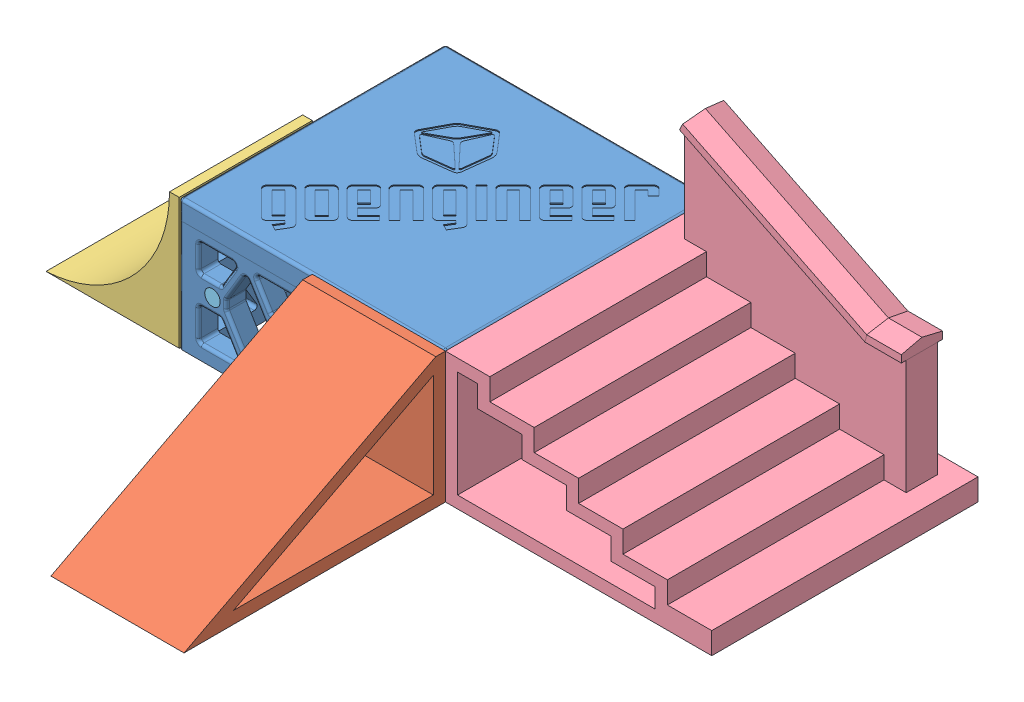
SolidWorks assembly Skate park - finished.SLDASM, configuration Default (file format 14000). Lengths in mm.
Overall size (349.28 125.08 276.86).
28 component instances, 5 part files, 64 mates.
Components (placement in the parent):
- Main base-1: Main base.SLDPRT [Default] at origin size (139.7 68.58 139.7)
- Ramp-1: Ramp.SLDPRT [Default] at (34.925 -68.58 69.85) x (0 0 1) z (-1 0 0) size (137.16 68.58 69.85)
- Ramp2-1: Ramp2.SLDPRT [Default] at (-69.85 -68.58 34.925) x (-1 0 0) z (0 0 -1) size (69.88 68.58 69.85)
- Steps-1: Steps.SLDPRT [Default] at (69.85 -68.58 0) size (139.7 125.08 139.7)
- Magnet-finished-1: Magnet-finished.SLDPRT [Default] at (-52.3875 -36.83 66.802) x (1 0 0) z (0 -1 0) size (8.13 3.05 8.13)
- Magnet-finished-2: Magnet-finished.SLDPRT [Default] at (-17.4625 -36.83 66.802) x (1 0 0) z (0 -1 0) size (8.13 3.05 8.13)
- Magnet-finished-3: Magnet-finished.SLDPRT [Default] at (17.4625 -36.83 66.802) x (1 0 0) z (0 -1 0) size (8.13 3.05 8.13)
- Magnet-finished-4: Magnet-finished.SLDPRT [Default] at (52.3875 -36.83 66.802) x (1 0 0) z (0 -1 0) size (8.13 3.05 8.13)
- Magnet-finished-5: Magnet-finished.SLDPRT [Default] at (66.802 -36.83 52.3875) x (0 -1 0) z (0 0 1) size (8.13 3.05 8.13)
- Magnet-finished-6: Magnet-finished.SLDPRT [Default] at (66.802 -36.83 17.4625) x (0 -1 0) z (0 0 1) size (8.13 3.05 8.13)
- Magnet-finished-9: Magnet-finished.SLDPRT [Default] at (52.3875 -36.83 -66.802) x (1 0 0) z (0 1 0) size (8.13 3.05 8.13)
- Magnet-finished-10: Magnet-finished.SLDPRT [Default] at (17.4625 -36.83 -66.802) x (1 0 0) z (0 1 0) size (8.13 3.05 8.13)
- Magnet-finished-11: Magnet-finished.SLDPRT [Default] at (-17.4625 -36.83 -66.802) x (1 0 0) z (0 1 0) size (8.13 3.05 8.13)
- Magnet-finished-13: Magnet-finished.SLDPRT [Default] at (-66.802 -36.83 -52.3875) x (0 1 0) z (0 0 1) size (8.13 3.05 8.13)
- Magnet-finished-14: Magnet-finished.SLDPRT [Default] at (-66.802 -36.83 -17.4625) x (0 1 0) z (0 0 1) size (8.13 3.05 8.13)
- Magnet-finished-15: Magnet-finished.SLDPRT [Default] at (-66.802 -36.83 17.4625) x (0 1 0) z (0 0 1) size (8.13 3.05 8.13)
- Magnet-finished-16: Magnet-finished.SLDPRT [Default] at (-66.802 -36.83 52.3875) x (0 1 0) z (0 0 1) size (8.13 3.05 8.13)
- Magnet-finished-17: Magnet-finished.SLDPRT [Default] at (66.802 -36.83 -52.3875) x (0 -1 0) z (0 0 1) size (8.13 3.05 8.13)
- Magnet-finished-19: Magnet-finished.SLDPRT [Default] at (-52.3875 -36.83 -66.802) x (1 0 0) z (0 1 0) size (8.13 3.05 8.13)
- Magnet-finished-21: Magnet-finished.SLDPRT [Default] at (66.802 -36.83 -17.4625) x (0 -1 0) z (0 0 1) size (8.13 3.05 8.13)
- Magnet-finished-22: Magnet-finished.SLDPRT [Default] at (52.3875 -36.83 69.85) x (-0.265294 -0.964167 0) z (-0.964167 0.265294 0) size (8.13 3.05 8.13)
- Magnet-finished-23: Magnet-finished.SLDPRT [Default] at (17.4625 -36.83 69.85) x (0.90035 0.435167 0) z (0.435167 -0.90035 0) size (8.13 3.05 8.13)
- Magnet-finished-24: Magnet-finished.SLDPRT [Default] at (69.85 -36.83 52.3875) x (0 0.924225 0.381849) z (0 0.381849 -0.924225) size (8.13 3.05 8.13)
- Magnet-finished-25: Magnet-finished.SLDPRT [Default] at (69.85 -36.83 17.4625) x (0 0.924225 0.381849) z (0 0.381849 -0.924225) size (8.13 3.05 8.13)
- Magnet-finished-26: Magnet-finished.SLDPRT [Default] at (69.85 -36.83 -17.4625) x (0 0.924225 0.381849) z (0 0.381849 -0.924225) size (8.13 3.05 8.13)
- Magnet-finished-27: Magnet-finished.SLDPRT [Default] at (69.85 -36.83 -52.3875) x (0 0.924225 0.381849) z (0 0.381849 -0.924225) size (8.13 3.05 8.13)
- Magnet-finished-28: Magnet-finished.SLDPRT [Default] at (-69.85 -36.83 52.3875) x (0 -0.995715 0.09248) z (0 -0.09248 -0.995715) size (8.13 3.05 8.13)
- Magnet-finished-29: Magnet-finished.SLDPRT [Default] at (-69.85 -36.83 17.4625) x (0 0.465685 0.88495) z (0 -0.88495 0.465685) size (8.13 3.05 8.13)
Mates (geometry in assembly coordinates):
- Concentric11: concentric anti-aligned: cylinder of Main base-1 through (-52.3875 -36.83 66.802) axis (0 0 1) radius 4.064; cylinder of Magnet-1 through (-52.3875 -36.83 69.85) axis (0 0 -1) radius 4.064
- Coincident11: coincident anti-aligned: plane of Main base-1 through (-52.3875 -36.83 66.802) normal (0 0 1); plane of Magnet-1 through (-52.3875 -36.83 66.802) normal (0 0 -1)
- Concentric21: concentric anti-aligned: cylinder of Main base-1 through (-17.4625 -36.83 66.802) axis (0 0 1) radius 4.064; cylinder of Magnet-2 through (-17.4625 -36.83 69.85) axis (0 0 -1) radius 4.064
- Coincident21: coincident anti-aligned: plane of Main base-1 through (-17.4625 -36.83 66.802) normal (0 0 1); plane of Magnet-2 through (-17.4625 -36.83 66.802) normal (0 0 -1)
- Concentric31: concentric anti-aligned: cylinder of Main base-1 through (17.4625 -36.83 66.802) axis (0 0 1) radius 4.064; cylinder of Magnet-3 through (17.4625 -36.83 69.85) axis (0 0 -1) radius 4.064
- Coincident31: coincident anti-aligned: plane of Main base-1 through (17.4625 -36.83 66.802) normal (0 0 1); plane of Magnet-3 through (17.4625 -36.83 66.802) normal (0 0 -1)
- Concentric41: concentric anti-aligned: cylinder of Main base-1 through (52.3875 -36.83 66.802) axis (0 0 1) radius 4.064; cylinder of Magnet-4 through (52.3875 -36.83 69.85) axis (0 0 -1) radius 4.064
- Coincident41: coincident anti-aligned: plane of Main base-1 through (52.3875 -36.83 66.802) normal (0 0 1); plane of Magnet-4 through (52.3875 -36.83 66.802) normal (0 0 -1)
- Concentric51: concentric anti-aligned: cylinder of Main base-1 through (66.802 -36.83 52.3875) axis (1 0 0) radius 4.064; cylinder of Magnet-5 through (69.85 -36.83 52.3875) axis (-1 0 0) radius 4.064
- Coincident51: coincident anti-aligned: plane of Main base-1 through (66.802 -36.83 52.3875) normal (1 0 0); plane of Magnet-5 through (66.802 -36.83 52.3875) normal (-1 0 0)
- Concentric61: concentric anti-aligned: cylinder of Main base-1 through (66.802 -36.83 17.4625) axis (1 0 0) radius 4.064; cylinder of Magnet-6 through (69.85 -36.83 17.4625) axis (-1 0 0) radius 4.064
- Coincident61: coincident anti-aligned: plane of Main base-1 through (66.802 -36.83 17.4625) normal (1 0 0); plane of Magnet-6 through (66.802 -36.83 17.4625) normal (-1 0 0)
- Coincident71: coincident anti-aligned: plane of Main base-1 through (69.85 -10.16 -59.69) normal (1 0 0); plane of Magnet-8 through (69.85 -54.2156 -62.8356) normal (-1 0 0)
- Concentric71: concentric anti-aligned: cylinder of Main base-1 through (52.3875 -36.83 -66.802) axis (0 0 -1) radius 4.064; cylinder of Magnet-9 through (52.3875 -36.83 -69.85) axis (0 0 1) radius 4.064
- Coincident81: coincident anti-aligned: plane of Main base-1 through (52.3875 -36.83 -66.802) normal (0 0 -1); plane of Magnet-9 through (52.3875 -36.83 -66.802) normal (0 0 1)
- Concentric81: concentric anti-aligned: cylinder of Main base-1 through (17.4625 -36.83 -66.802) axis (0 0 -1) radius 4.064; cylinder of Magnet-10 through (17.4625 -36.83 -69.85) axis (0 0 1) radius 4.064
- Coincident91: coincident anti-aligned: plane of Main base-1 through (17.4625 -36.83 -66.802) normal (0 0 -1); plane of Magnet-10 through (17.4625 -36.83 -66.802) normal (0 0 1)
- Concentric91: concentric anti-aligned: cylinder of Main base-1 through (-17.4625 -36.83 -66.802) axis (0 0 -1) radius 4.064; cylinder of Magnet-11 through (-17.4625 -36.83 -69.85) axis (0 0 1) radius 4.064
- Coincident101: coincident anti-aligned: plane of Main base-1 through (-17.4625 -36.83 -66.802) normal (0 0 -1); plane of Magnet-11 through (-17.4625 -36.83 -66.802) normal (0 0 1)
- Concentric101: concentric: cylinder of Main base-1 through (-52.3875 -36.83 -66.802) axis (0 0 -1) radius 4.064; cylinder of Magnet-12 through (-58.2387 -35.1591 -64.283) axis (0 -1 0) radius 4.064
- Coincident111: coincident: plane of Main base-1 through (0 0 -69.85) normal (0 0 -1); plane of Magnet-12 through (-58.2387 -38.2071 -64.283) normal (0 -1 0)
- Concentric111: concentric anti-aligned: cylinder of Main base-1 through (-66.802 -36.83 -52.3875) axis (-1 0 0) radius 4.064; cylinder of Magnet-13 through (-69.85 -36.83 -52.3875) axis (1 0 0) radius 4.064
- Coincident121: coincident anti-aligned: plane of Main base-1 through (-66.802 -36.83 -52.3875) normal (-1 0 0); plane of Magnet-13 through (-66.802 -36.83 -52.3875) normal (1 0 0)
- Concentric121: concentric anti-aligned: cylinder of Main base-1 through (-66.802 -36.83 -17.4625) axis (-1 0 0) radius 4.064; cylinder of Magnet-14 through (-69.85 -36.83 -17.4625) axis (1 0 0) radius 4.064
- Coincident131: coincident anti-aligned: plane of Main base-1 through (-66.802 -36.83 -17.4625) normal (-1 0 0); plane of Magnet-14 through (-66.802 -36.83 -17.4625) normal (1 0 0)
- Concentric131: concentric anti-aligned: cylinder of Main base-1 through (-66.802 -36.83 17.4625) axis (-1 0 0) radius 4.064; cylinder of Magnet-15 through (-69.85 -36.83 17.4625) axis (1 0 0) radius 4.064
- Coincident141: coincident anti-aligned: plane of Main base-1 through (-66.802 -36.83 17.4625) normal (-1 0 0); plane of Magnet-15 through (-66.802 -36.83 17.4625) normal (1 0 0)
- Concentric141: concentric anti-aligned: cylinder of Main base-1 through (-66.802 -36.83 52.3875) axis (-1 0 0) radius 4.064; cylinder of Magnet-16 through (-69.85 -36.83 52.3875) axis (1 0 0) radius 4.064
- Coincident151: coincident anti-aligned: plane of Main base-1 through (-66.802 -36.83 52.3875) normal (-1 0 0); plane of Magnet-16 through (-66.802 -36.83 52.3875) normal (1 0 0)
- Concentric151: concentric anti-aligned: cylinder of Main base-1 through (66.802 -36.83 -52.3875) axis (1 0 0) radius 4.064; cylinder of Magnet-17 through (69.85 -36.83 -52.3875) axis (-1 0 0) radius 4.064
- Coincident161: coincident anti-aligned: plane of Main base-1 through (66.802 -36.83 -52.3875) normal (1 0 0); plane of Magnet-17 through (66.802 -36.83 -52.3875) normal (-1 0 0)
- Concentric161: concentric: cylinder of Main base-1 through (66.802 -36.83 -17.4625) axis (1 0 0) radius 4.064; cylinder of Magnet-18 through (21.8362 -48.4419 20.2448) axis (0 -1 0) radius 4.064
- Coincident171: coincident: plane of Main base-1 through (69.85 0 0) normal (1 0 0); plane of Magnet-18 through (21.8362 -51.4899 20.2448) normal (0 -1 0)
- Concentric171: concentric anti-aligned: cylinder of Main base-1 through (-52.3875 -36.83 -66.802) axis (0 0 -1) radius 4.064; cylinder of Magnet-19 through (-52.3875 -36.83 -69.85) axis (0 0 1) radius 4.064
- Coincident181: coincident anti-aligned: plane of Main base-1 through (-52.3875 -36.83 -66.802) normal (0 0 -1); plane of Magnet-19 through (-52.3875 -36.83 -66.802) normal (0 0 1)
- Concentric181: concentric: cylinder of Main base-1 through (66.802 -36.83 -17.4625) axis (1 0 0) radius 4.064; cylinder of Magnet-20 through (50.7957 -48.458 -37.7631) axis (0 -1 0) radius 4.064
- Coincident191: coincident: plane of Main base-1 through (69.85 0 0) normal (1 0 0); plane of Magnet-20 through (50.7957 -51.506 -37.7631) normal (0 -1 0)
- Concentric191: concentric anti-aligned: cylinder of Main base-1 through (66.802 -36.83 -17.4625) axis (1 0 0) radius 4.064; cylinder of Magnet-21 through (69.85 -36.83 -17.4625) axis (-1 0 0) radius 4.064
- Coincident201: coincident anti-aligned: plane of Main base-1 through (66.802 -36.83 -17.4625) normal (1 0 0); plane of Magnet-21 through (66.802 -36.83 -17.4625) normal (-1 0 0)
- Concentric201: concentric aligned: cylinder of Ramp-1 through (52.3875 -36.83 72.898) axis (0 0 -1) radius 4.064; cylinder of Magnet-22 through (52.3875 -36.83 72.898) axis (0 0 -1) radius 4.064
- Coincident211: coincident aligned: plane of Ramp-1 through (0 -68.58 69.85) normal (0 0 -1); plane of Magnet-22 through (52.3875 -36.83 69.85) normal (0 0 -1)
- Concentric211: concentric aligned: cylinder of Ramp-1 through (17.4625 -36.83 72.898) axis (0 0 -1) radius 4.064; cylinder of Magnet-23 through (17.4625 -36.83 72.898) axis (0 0 -1) radius 4.064
- Coincident221: coincident aligned: plane of Ramp-1 through (0 -68.58 69.85) normal (0 0 -1); plane of Magnet-23 through (17.4625 -36.83 69.85) normal (0 0 -1)
- Concentric221: concentric aligned: cylinder of Steps-1 through (72.898 -36.83 52.3875) axis (-1 0 0) radius 4.064; cylinder of Magnet-24 through (72.898 -36.83 52.3875) axis (-1 0 0) radius 4.064
- Coincident231: coincident aligned: plane of Steps-1 through (69.85 -68.58 69.85) normal (-1 0 0); plane of Magnet-24 through (69.85 -36.83 52.3875) normal (-1 0 0)
- Concentric231: concentric aligned: cylinder of Steps-1 through (72.898 -36.83 17.4625) axis (-1 0 0) radius 4.064; cylinder of Magnet-25 through (72.898 -36.83 17.4625) axis (-1 0 0) radius 4.064
- Coincident241: coincident aligned: plane of Steps-1 through (69.85 -68.58 69.85) normal (-1 0 0); plane of Magnet-25 through (69.85 -36.83 17.4625) normal (-1 0 0)
- Concentric241: concentric aligned: cylinder of Steps-1 through (72.898 -36.83 -17.4625) axis (-1 0 0) radius 4.064; cylinder of Magnet-26 through (72.898 -36.83 -17.4625) axis (-1 0 0) radius 4.064
- Coincident251: coincident aligned: plane of Steps-1 through (69.85 -68.58 69.85) normal (-1 0 0); plane of Magnet-26 through (69.85 -36.83 -17.4625) normal (-1 0 0)
- Concentric251: concentric aligned: cylinder of Steps-1 through (72.898 -36.83 -52.3875) axis (-1 0 0) radius 4.064; cylinder of Magnet-27 through (72.898 -36.83 -52.3875) axis (-1 0 0) radius 4.064
- Coincident261: coincident aligned: plane of Steps-1 through (69.85 -68.58 69.85) normal (-1 0 0); plane of Magnet-27 through (69.85 -36.83 -52.3875) normal (-1 0 0)
- Concentric261: concentric aligned: cylinder of Ramp2-1 through (-72.898 -36.83 52.3875) axis (1 0 0) radius 4.064; cylinder of Magnet-28 through (-72.898 -36.83 52.3875) axis (1 0 0) radius 4.064
- Coincident271: coincident aligned: plane of Ramp2-1 through (-69.85 -68.58 0) normal (1 0 0); plane of Magnet-28 through (-69.85 -36.83 52.3875) normal (1 0 0)
- Concentric271: concentric aligned: cylinder of Ramp2-1 through (-72.898 -36.83 17.4625) axis (1 0 0) radius 4.064; cylinder of Magnet-29 through (-72.898 -36.83 17.4625) axis (1 0 0) radius 4.064
- Coincident281: coincident aligned: plane of Ramp2-1 through (-69.85 -68.58 0) normal (1 0 0); plane of Magnet-29 through (-69.85 -36.83 17.4625) normal (1 0 0)
- Coincident29: coincident anti-aligned: plane of Main base-1 through (-69.85 0 0) normal (-1 0 0); plane of Ramp2-1 through (-69.85 -68.58 0) normal (1 0 0)
- Concentric28: concentric anti-aligned: cylinder of Main base-1 through (-66.802 -36.83 52.3875) axis (-1 0 0) radius 4.064; cylinder of Ramp2-1 through (-72.898 -36.83 52.3875) axis (1 0 0) radius 4.064
- Concentric29: concentric anti-aligned: cylinder of Main base-1 through (-66.802 -36.83 17.4625) axis (-1 0 0) radius 4.064; cylinder of Ramp2-1 through (-72.898 -36.83 17.4625) axis (1 0 0) radius 4.064
- Concentric30: concentric anti-aligned: cylinder of Main base-1 through (52.3875 -36.83 66.802) axis (0 0 1) radius 4.064; cylinder of Ramp-1 through (52.3875 -36.83 72.898) axis (0 0 -1) radius 4.064
- Concentric31: concentric anti-aligned: cylinder of Main base-1 through (17.4625 -36.83 66.802) axis (0 0 1) radius 4.064; cylinder of Ramp-1 through (17.4625 -36.83 72.898) axis (0 0 -1) radius 4.064
- Coincident30: coincident anti-aligned: plane of Main base-1 through (0 0 69.85) normal (0 0 1); plane of Ramp-1 through (0 -68.58 69.85) normal (0 0 -1)
- Concentric32: concentric anti-aligned: cylinder of Main base-1 through (66.802 -36.83 -52.3875) axis (1 0 0) radius 4.064; cylinder of Steps-1 through (72.898 -36.83 -52.3875) axis (-1 0 0) radius 4.064
- Concentric33: concentric anti-aligned: cylinder of Main base-1 through (66.802 -36.83 -17.4625) axis (1 0 0) radius 4.064; cylinder of Steps-1 through (72.898 -36.83 -17.4625) axis (-1 0 0) radius 4.064
- Coincident31: coincident anti-aligned: plane of Main base-1 through (69.85 0 0) normal (1 0 0); plane of Steps-1 through (69.85 -68.58 69.85) normal (-1 0 0)
